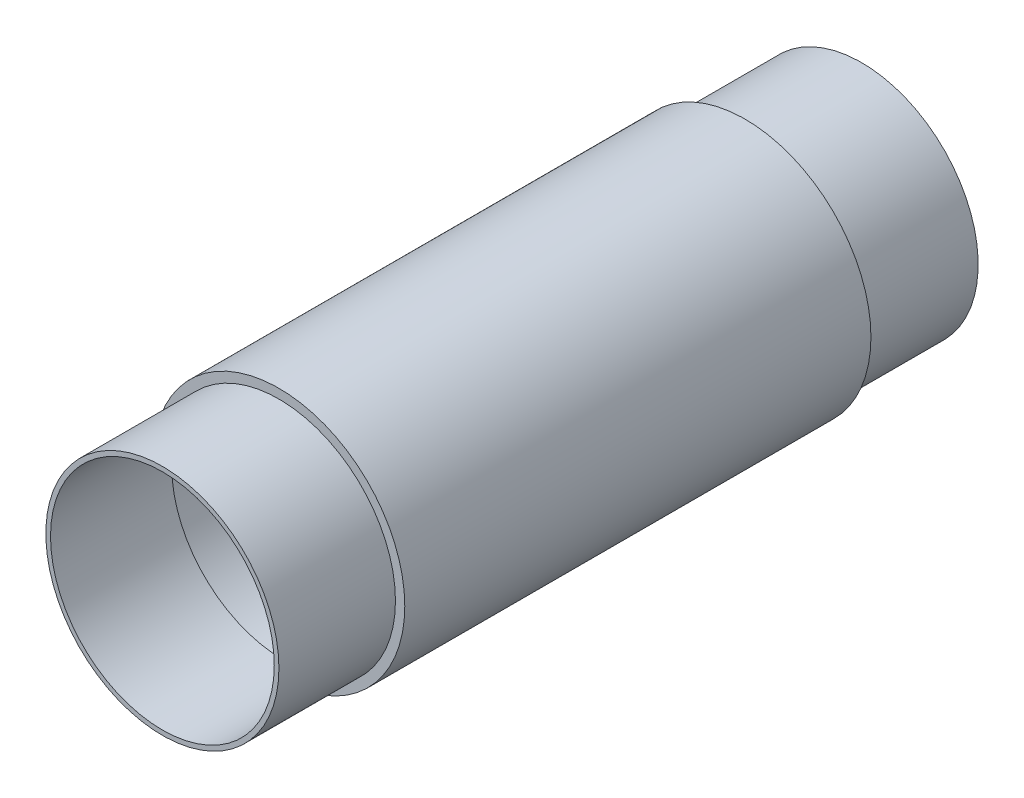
ISO-10303-21;
HEADER;
FILE_DESCRIPTION(('STEP AP214'),'2;1');
FILE_NAME('part.step','',(''),(''),'','','');
FILE_SCHEMA(('AUTOMOTIVE_DESIGN { 1 0 10303 214 1 1 1 1 }'));
ENDSEC;
DATA;
#1=APPLICATION_CONTEXT('core data for automotive mechanical design processes');
#2=APPLICATION_PROTOCOL_DEFINITION('international standard','automotive_design',2000,#1);
#3=PRODUCT_CONTEXT('',#1,'mechanical');
#4=PRODUCT('Part','Part','',(#3));
#5=PRODUCT_RELATED_PRODUCT_CATEGORY('part','',(#4));
#6=PRODUCT_DEFINITION_FORMATION('','',#4);
#7=PRODUCT_DEFINITION_CONTEXT('part definition',#1,'design');
#8=PRODUCT_DEFINITION('design','',#6,#7);
#9=PRODUCT_DEFINITION_SHAPE('','',#8);
#10=(LENGTH_UNIT() NAMED_UNIT(*) SI_UNIT(.MILLI.,.METRE.));
#11=(NAMED_UNIT(*) PLANE_ANGLE_UNIT() SI_UNIT($,.RADIAN.));
#12=(NAMED_UNIT(*) SI_UNIT($,.STERADIAN.) SOLID_ANGLE_UNIT());
#13=UNCERTAINTY_MEASURE_WITH_UNIT(LENGTH_MEASURE(1.E-05),#10,'distance_accuracy_value','');
#14=(GEOMETRIC_REPRESENTATION_CONTEXT(3) GLOBAL_UNCERTAINTY_ASSIGNED_CONTEXT((#13)) GLOBAL_UNIT_ASSIGNED_CONTEXT((#10,
#11,#12)) REPRESENTATION_CONTEXT('',''));
#15=CARTESIAN_POINT('',(0.,0.,0.));
#16=DIRECTION('',(0.,0.,1.));
#17=DIRECTION('',(1.,0.,0.));
#18=AXIS2_PLACEMENT_3D('',#15,#16,#17);
#19=CARTESIAN_POINT('',(0.,0.,75.));
#20=DIRECTION('',(0.,0.,1.));
#21=DIRECTION('',(1.,0.,0.));
#22=AXIS2_PLACEMENT_3D('',#19,#20,#21);
#23=PLANE('',#22);
#24=CARTESIAN_POINT('',(0.,0.,75.));
#25=DIRECTION('',(0.,0.,1.));
#26=DIRECTION('',(1.,0.,0.));
#27=AXIS2_PLACEMENT_3D('',#24,#25,#26);
#28=CIRCLE('',#27,25.);
#29=CARTESIAN_POINT('',(25.,0.,75.));
#30=VERTEX_POINT('',#29);
#31=EDGE_CURVE('E11',#30,#30,#28,.T.);
#32=ORIENTED_EDGE('',*,*,#31,.T.);
#33=EDGE_LOOP('',(#32));
#34=FACE_BOUND('',#33,.T.);
#35=CARTESIAN_POINT('',(0.,0.,75.));
#36=DIRECTION('',(0.,0.,1.));
#37=DIRECTION('',(1.,0.,0.));
#38=AXIS2_PLACEMENT_3D('',#35,#36,#37);
#39=CIRCLE('',#38,24.);
#40=CARTESIAN_POINT('',(24.,0.,75.));
#41=VERTEX_POINT('',#40);
#42=EDGE_CURVE('E53',#41,#41,#39,.T.);
#43=ORIENTED_EDGE('',*,*,#42,.F.);
#44=EDGE_LOOP('',(#43));
#45=FACE_BOUND('',#44,.T.);
#46=ADVANCED_FACE('F46',(#34,#45),#23,.T.);
#47=CARTESIAN_POINT('',(0.,0.,75.));
#48=DIRECTION('',(0.,0.,-1.));
#49=DIRECTION('',(-1.,0.,0.));
#50=AXIS2_PLACEMENT_3D('',#47,#48,#49);
#51=CYLINDRICAL_SURFACE('',#50,25.);
#52=ORIENTED_EDGE('',*,*,#31,.F.);
#53=EDGE_LOOP('',(#52));
#54=FACE_BOUND('',#53,.T.);
#55=CARTESIAN_POINT('',(0.,0.,49.));
#56=DIRECTION('',(0.,0.,1.));
#57=DIRECTION('',(1.,0.,0.));
#58=AXIS2_PLACEMENT_3D('',#55,#56,#57);
#59=CIRCLE('',#58,25.);
#60=CARTESIAN_POINT('',(25.,0.,49.));
#61=VERTEX_POINT('',#60);
#62=EDGE_CURVE('E57',#61,#61,#59,.T.);
#63=ORIENTED_EDGE('',*,*,#62,.T.);
#64=EDGE_LOOP('',(#63));
#65=FACE_BOUND('',#64,.T.);
#66=ADVANCED_FACE('F48',(#54,#65),#51,.T.);
#67=CARTESIAN_POINT('',(0.,0.,75.));
#68=DIRECTION('',(0.,0.,-1.));
#69=DIRECTION('',(-1.,0.,0.));
#70=AXIS2_PLACEMENT_3D('',#67,#68,#69);
#71=CYLINDRICAL_SURFACE('',#70,24.);
#72=ORIENTED_EDGE('',*,*,#42,.T.);
#73=EDGE_LOOP('',(#72));
#74=FACE_BOUND('',#73,.T.);
#75=CARTESIAN_POINT('',(0.,0.,49.));
#76=DIRECTION('',(0.,0.,1.));
#77=DIRECTION('',(1.,0.,0.));
#78=AXIS2_PLACEMENT_3D('',#75,#76,#77);
#79=CIRCLE('',#78,24.);
#80=CARTESIAN_POINT('',(24.,0.,49.));
#81=VERTEX_POINT('',#80);
#82=EDGE_CURVE('E61',#81,#81,#79,.T.);
#83=ORIENTED_EDGE('',*,*,#82,.F.);
#84=EDGE_LOOP('',(#83));
#85=FACE_BOUND('',#84,.T.);
#86=ADVANCED_FACE('F70',(#74,#85),#71,.F.);
#87=CARTESIAN_POINT('',(0.,0.,49.));
#88=DIRECTION('',(0.,0.,1.));
#89=DIRECTION('',(1.,0.,0.));
#90=AXIS2_PLACEMENT_3D('',#87,#88,#89);
#91=PLANE('',#90);
#92=ORIENTED_EDGE('',*,*,#82,.T.);
#93=EDGE_LOOP('',(#92));
#94=FACE_BOUND('',#93,.T.);
#95=ORIENTED_EDGE('',*,*,#62,.F.);
#96=EDGE_LOOP('',(#95));
#97=FACE_BOUND('',#96,.T.);
#98=ADVANCED_FACE('F67',(#94,#97),#91,.F.);
#99=CLOSED_SHELL('',(#46,#66,#86,#98));
#100=MANIFOLD_SOLID_BREP('B2',#99);
#101=CARTESIAN_POINT('',(0.,0.,-75.));
#102=DIRECTION('',(0.,0.,-1.));
#103=DIRECTION('',(-1.,0.,0.));
#104=AXIS2_PLACEMENT_3D('',#101,#102,#103);
#105=PLANE('',#104);
#106=CARTESIAN_POINT('',(0.,0.,-75.));
#107=DIRECTION('',(0.,0.,-1.));
#108=DIRECTION('',(-1.,0.,0.));
#109=AXIS2_PLACEMENT_3D('',#106,#107,#108);
#110=CIRCLE('',#109,25.);
#111=CARTESIAN_POINT('',(-25.,0.,-75.));
#112=VERTEX_POINT('',#111);
#113=EDGE_CURVE('E45',#112,#112,#110,.T.);
#114=ORIENTED_EDGE('',*,*,#113,.T.);
#115=EDGE_LOOP('',(#114));
#116=FACE_BOUND('',#115,.T.);
#117=CARTESIAN_POINT('',(0.,0.,-75.));
#118=DIRECTION('',(0.,0.,-1.));
#119=DIRECTION('',(-1.,0.,0.));
#120=AXIS2_PLACEMENT_3D('',#117,#118,#119);
#121=CIRCLE('',#120,24.);
#122=CARTESIAN_POINT('',(-24.,0.,-75.));
#123=VERTEX_POINT('',#122);
#124=EDGE_CURVE('E122',#123,#123,#121,.T.);
#125=ORIENTED_EDGE('',*,*,#124,.F.);
#126=EDGE_LOOP('',(#125));
#127=FACE_BOUND('',#126,.T.);
#128=ADVANCED_FACE('F115',(#116,#127),#105,.T.);
#129=CARTESIAN_POINT('',(0.,0.,-75.));
#130=DIRECTION('',(0.,0.,1.));
#131=DIRECTION('',(1.,0.,0.));
#132=AXIS2_PLACEMENT_3D('',#129,#130,#131);
#133=CYLINDRICAL_SURFACE('',#132,25.);
#134=ORIENTED_EDGE('',*,*,#113,.F.);
#135=EDGE_LOOP('',(#134));
#136=FACE_BOUND('',#135,.T.);
#137=CARTESIAN_POINT('',(0.,0.,-49.));
#138=DIRECTION('',(0.,0.,-1.));
#139=DIRECTION('',(-1.,0.,0.));
#140=AXIS2_PLACEMENT_3D('',#137,#138,#139);
#141=CIRCLE('',#140,25.);
#142=CARTESIAN_POINT('',(-25.,0.,-49.));
#143=VERTEX_POINT('',#142);
#144=EDGE_CURVE('E126',#143,#143,#141,.T.);
#145=ORIENTED_EDGE('',*,*,#144,.T.);
#146=EDGE_LOOP('',(#145));
#147=FACE_BOUND('',#146,.T.);
#148=ADVANCED_FACE('F117',(#136,#147),#133,.T.);
#149=CARTESIAN_POINT('',(0.,0.,-75.));
#150=DIRECTION('',(0.,0.,1.));
#151=DIRECTION('',(1.,0.,0.));
#152=AXIS2_PLACEMENT_3D('',#149,#150,#151);
#153=CYLINDRICAL_SURFACE('',#152,24.);
#154=ORIENTED_EDGE('',*,*,#124,.T.);
#155=EDGE_LOOP('',(#154));
#156=FACE_BOUND('',#155,.T.);
#157=CARTESIAN_POINT('',(0.,0.,-49.));
#158=DIRECTION('',(0.,0.,-1.));
#159=DIRECTION('',(-1.,0.,0.));
#160=AXIS2_PLACEMENT_3D('',#157,#158,#159);
#161=CIRCLE('',#160,24.);
#162=CARTESIAN_POINT('',(-24.,0.,-49.));
#163=VERTEX_POINT('',#162);
#164=EDGE_CURVE('E130',#163,#163,#161,.T.);
#165=ORIENTED_EDGE('',*,*,#164,.F.);
#166=EDGE_LOOP('',(#165));
#167=FACE_BOUND('',#166,.T.);
#168=ADVANCED_FACE('F139',(#156,#167),#153,.F.);
#169=CARTESIAN_POINT('',(0.,0.,-49.));
#170=DIRECTION('',(0.,0.,-1.));
#171=DIRECTION('',(-1.,0.,0.));
#172=AXIS2_PLACEMENT_3D('',#169,#170,#171);
#173=PLANE('',#172);
#174=ORIENTED_EDGE('',*,*,#164,.T.);
#175=EDGE_LOOP('',(#174));
#176=FACE_BOUND('',#175,.T.);
#177=ORIENTED_EDGE('',*,*,#144,.F.);
#178=EDGE_LOOP('',(#177));
#179=FACE_BOUND('',#178,.T.);
#180=ADVANCED_FACE('F136',(#176,#179),#173,.F.);
#181=CLOSED_SHELL('',(#128,#148,#168,#180));
#182=MANIFOLD_SOLID_BREP('B6',#181);
#183=CARTESIAN_POINT('',(0.,0.,50.));
#184=DIRECTION('',(0.,0.,1.));
#185=DIRECTION('',(1.,0.,0.));
#186=AXIS2_PLACEMENT_3D('',#183,#184,#185);
#187=PLANE('',#186);
#188=CARTESIAN_POINT('',(0.,0.,50.));
#189=DIRECTION('',(0.,0.,1.));
#190=DIRECTION('',(1.,0.,0.));
#191=AXIS2_PLACEMENT_3D('',#188,#189,#190);
#192=CIRCLE('',#191,27.);
#193=CARTESIAN_POINT('',(27.,0.,50.));
#194=VERTEX_POINT('',#193);
#195=EDGE_CURVE('E114',#194,#194,#192,.T.);
#196=ORIENTED_EDGE('',*,*,#195,.T.);
#197=EDGE_LOOP('',(#196));
#198=FACE_BOUND('',#197,.T.);
#199=CARTESIAN_POINT('',(0.,0.,50.));
#200=DIRECTION('',(0.,0.,1.));
#201=DIRECTION('',(1.,0.,0.));
#202=AXIS2_PLACEMENT_3D('',#199,#200,#201);
#203=CIRCLE('',#202,25.);
#204=CARTESIAN_POINT('',(25.,0.,50.));
#205=VERTEX_POINT('',#204);
#206=EDGE_CURVE('E185',#205,#205,#203,.T.);
#207=ORIENTED_EDGE('',*,*,#206,.F.);
#208=EDGE_LOOP('',(#207));
#209=FACE_BOUND('',#208,.T.);
#210=ADVANCED_FACE('F177',(#198,#209),#187,.T.);
#211=CARTESIAN_POINT('',(0.,0.,50.));
#212=DIRECTION('',(0.,0.,-1.));
#213=DIRECTION('',(-1.,0.,0.));
#214=AXIS2_PLACEMENT_3D('',#211,#212,#213);
#215=CYLINDRICAL_SURFACE('',#214,27.);
#216=ORIENTED_EDGE('',*,*,#195,.F.);
#217=EDGE_LOOP('',(#216));
#218=FACE_BOUND('',#217,.T.);
#219=CARTESIAN_POINT('',(0.,0.,-50.));
#220=DIRECTION('',(0.,0.,1.));
#221=DIRECTION('',(1.,0.,0.));
#222=AXIS2_PLACEMENT_3D('',#219,#220,#221);
#223=CIRCLE('',#222,27.);
#224=CARTESIAN_POINT('',(27.,0.,-50.));
#225=VERTEX_POINT('',#224);
#226=EDGE_CURVE('E190',#225,#225,#223,.T.);
#227=ORIENTED_EDGE('',*,*,#226,.T.);
#228=EDGE_LOOP('',(#227));
#229=FACE_BOUND('',#228,.T.);
#230=ADVANCED_FACE('F179',(#218,#229),#215,.T.);
#231=CARTESIAN_POINT('',(0.,0.,50.));
#232=DIRECTION('',(0.,0.,-1.));
#233=DIRECTION('',(-1.,0.,0.));
#234=AXIS2_PLACEMENT_3D('',#231,#232,#233);
#235=CYLINDRICAL_SURFACE('',#234,25.);
#236=ORIENTED_EDGE('',*,*,#206,.T.);
#237=EDGE_LOOP('',(#236));
#238=FACE_BOUND('',#237,.T.);
#239=CARTESIAN_POINT('',(0.,0.,-50.));
#240=DIRECTION('',(0.,0.,1.));
#241=DIRECTION('',(1.,0.,0.));
#242=AXIS2_PLACEMENT_3D('',#239,#240,#241);
#243=CIRCLE('',#242,25.);
#244=CARTESIAN_POINT('',(25.,0.,-50.));
#245=VERTEX_POINT('',#244);
#246=EDGE_CURVE('E195',#245,#245,#243,.T.);
#247=ORIENTED_EDGE('',*,*,#246,.F.);
#248=EDGE_LOOP('',(#247));
#249=FACE_BOUND('',#248,.T.);
#250=ADVANCED_FACE('F205',(#238,#249),#235,.F.);
#251=CARTESIAN_POINT('',(0.,0.,-50.));
#252=DIRECTION('',(0.,0.,1.));
#253=DIRECTION('',(1.,0.,0.));
#254=AXIS2_PLACEMENT_3D('',#251,#252,#253);
#255=PLANE('',#254);
#256=ORIENTED_EDGE('',*,*,#246,.T.);
#257=EDGE_LOOP('',(#256));
#258=FACE_BOUND('',#257,.T.);
#259=ORIENTED_EDGE('',*,*,#226,.F.);
#260=EDGE_LOOP('',(#259));
#261=FACE_BOUND('',#260,.T.);
#262=ADVANCED_FACE('F202',(#258,#261),#255,.F.);
#263=CLOSED_SHELL('',(#210,#230,#250,#262));
#264=MANIFOLD_SOLID_BREP('B40',#263);
#265=ADVANCED_BREP_SHAPE_REPRESENTATION('',(#18,#100,#182,#264),#14);
#266=SHAPE_DEFINITION_REPRESENTATION(#9,#265);
ENDSEC;
END-ISO-10303-21;
